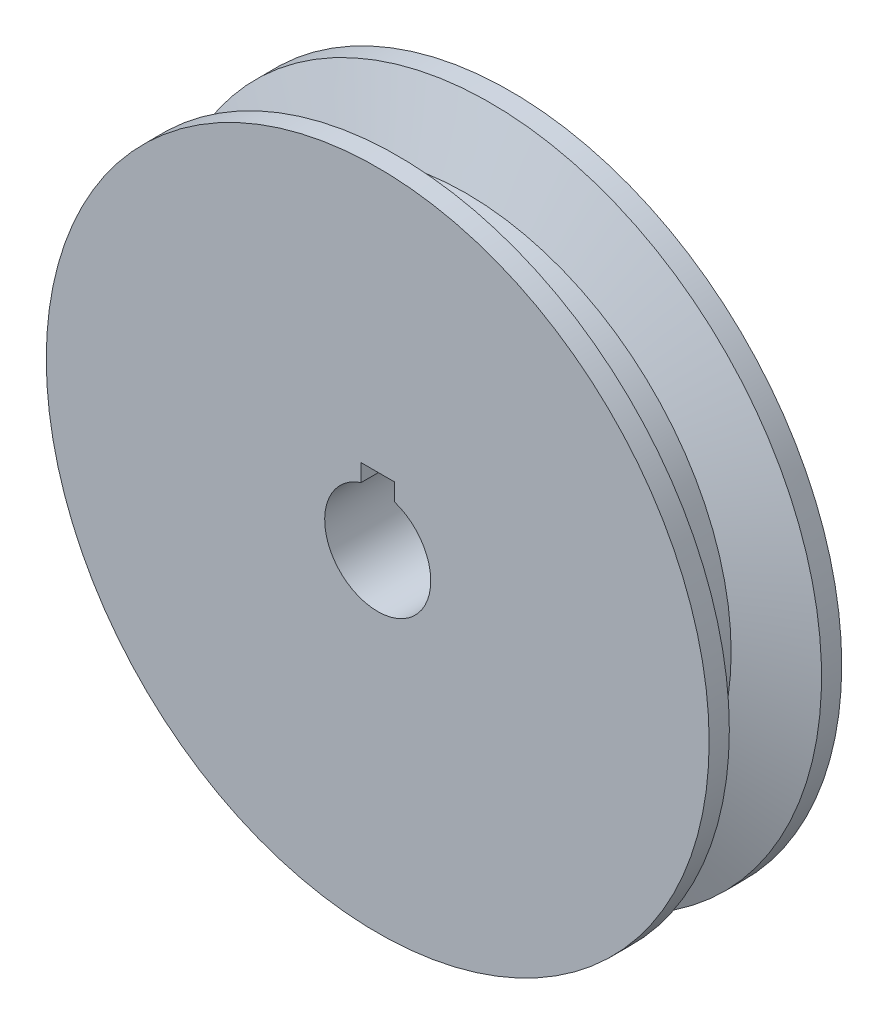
ISO-10303-21;
HEADER;
FILE_DESCRIPTION(('STEP AP214'),'2;1');
FILE_NAME('part.step','',(''),(''),'','','');
FILE_SCHEMA(('AUTOMOTIVE_DESIGN { 1 0 10303 214 1 1 1 1 }'));
ENDSEC;
DATA;
#1=APPLICATION_CONTEXT('core data for automotive mechanical design processes');
#2=APPLICATION_PROTOCOL_DEFINITION('international standard','automotive_design',2000,#1);
#3=PRODUCT_CONTEXT('',#1,'mechanical');
#4=PRODUCT('Part','Part','',(#3));
#5=PRODUCT_RELATED_PRODUCT_CATEGORY('part','',(#4));
#6=PRODUCT_DEFINITION_FORMATION('','',#4);
#7=PRODUCT_DEFINITION_CONTEXT('part definition',#1,'design');
#8=PRODUCT_DEFINITION('design','',#6,#7);
#9=PRODUCT_DEFINITION_SHAPE('','',#8);
#10=(LENGTH_UNIT() NAMED_UNIT(*) SI_UNIT(.MILLI.,.METRE.));
#11=(NAMED_UNIT(*) PLANE_ANGLE_UNIT() SI_UNIT($,.RADIAN.));
#12=(NAMED_UNIT(*) SI_UNIT($,.STERADIAN.) SOLID_ANGLE_UNIT());
#13=UNCERTAINTY_MEASURE_WITH_UNIT(LENGTH_MEASURE(1.E-05),#10,'distance_accuracy_value','');
#14=(GEOMETRIC_REPRESENTATION_CONTEXT(3) GLOBAL_UNCERTAINTY_ASSIGNED_CONTEXT((#13)) GLOBAL_UNIT_ASSIGNED_CONTEXT((#10,
#11,#12)) REPRESENTATION_CONTEXT('',''));
#15=CARTESIAN_POINT('',(0.,0.,0.));
#16=DIRECTION('',(0.,0.,1.));
#17=DIRECTION('',(1.,0.,0.));
#18=AXIS2_PLACEMENT_3D('',#15,#16,#17);
#19=CARTESIAN_POINT('',(0.,0.,10.));
#20=DIRECTION('',(0.,0.,-1.));
#21=DIRECTION('',(-1.,0.,0.));
#22=AXIS2_PLACEMENT_3D('',#19,#20,#21);
#23=CYLINDRICAL_SURFACE('',#22,50.);
#24=CARTESIAN_POINT('',(0.,0.,-10.));
#25=DIRECTION('',(0.,0.,1.));
#26=DIRECTION('',(1.,0.,0.));
#27=AXIS2_PLACEMENT_3D('',#24,#25,#26);
#28=CIRCLE('',#27,50.);
#29=CARTESIAN_POINT('',(50.,0.,-10.));
#30=VERTEX_POINT('',#29);
#31=EDGE_CURVE('E110',#30,#30,#28,.T.);
#32=ORIENTED_EDGE('',*,*,#31,.T.);
#33=EDGE_LOOP('',(#32));
#34=FACE_BOUND('',#33,.T.);
#35=CARTESIAN_POINT('',(0.,0.,-6.9558809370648));
#36=DIRECTION('',(0.,0.,-1.));
#37=DIRECTION('',(-1.,0.,0.));
#38=AXIS2_PLACEMENT_3D('',#35,#36,#37);
#39=CIRCLE('',#38,50.);
#40=CARTESIAN_POINT('',(-50.,0.,-6.9558809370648));
#41=VERTEX_POINT('',#40);
#42=EDGE_CURVE('E90',#41,#41,#39,.T.);
#43=ORIENTED_EDGE('',*,*,#42,.T.);
#44=EDGE_LOOP('',(#43));
#45=FACE_BOUND('',#44,.T.);
#46=ADVANCED_FACE('F32',(#34,#45),#23,.T.);
#47=CARTESIAN_POINT('',(0.,0.,10.));
#48=DIRECTION('',(0.,0.,1.));
#49=DIRECTION('',(1.,0.,0.));
#50=AXIS2_PLACEMENT_3D('',#47,#48,#49);
#51=PLANE('',#50);
#52=DIRECTION('',(0.,1.,0.));
#53=VECTOR('',#52,1.);
#54=CARTESIAN_POINT('',(2.5,10.2,10.));
#55=LINE('',#54,#53);
#56=CARTESIAN_POINT('',(2.5,7.59934207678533,10.));
#57=VERTEX_POINT('',#56);
#58=CARTESIAN_POINT('',(2.5,10.2,10.));
#59=VERTEX_POINT('',#58);
#60=EDGE_CURVE('E84',#57,#59,#55,.T.);
#61=ORIENTED_EDGE('',*,*,#60,.F.);
#62=CARTESIAN_POINT('',(0.,0.,10.));
#63=DIRECTION('',(0.,0.,1.));
#64=DIRECTION('',(1.,0.,0.));
#65=AXIS2_PLACEMENT_3D('',#62,#63,#64);
#66=CIRCLE('',#65,8.);
#67=CARTESIAN_POINT('',(-2.5,7.59934207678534,10.));
#68=VERTEX_POINT('',#67);
#69=EDGE_CURVE('E113',#68,#57,#66,.T.);
#70=ORIENTED_EDGE('',*,*,#69,.F.);
#71=DIRECTION('',(0.,-1.,0.));
#72=VECTOR('',#71,1.);
#73=CARTESIAN_POINT('',(-2.5,10.2,10.));
#74=LINE('',#73,#72);
#75=CARTESIAN_POINT('',(-2.5,10.2,10.));
#76=VERTEX_POINT('',#75);
#77=EDGE_CURVE('E94',#76,#68,#74,.T.);
#78=ORIENTED_EDGE('',*,*,#77,.F.);
#79=DIRECTION('',(-1.,0.,0.));
#80=VECTOR('',#79,1.);
#81=CARTESIAN_POINT('',(-2.5,10.2,10.));
#82=LINE('',#81,#80);
#83=EDGE_CURVE('E77',#59,#76,#82,.T.);
#84=ORIENTED_EDGE('',*,*,#83,.F.);
#85=EDGE_LOOP('',(#61,#70,#78,#84));
#86=FACE_BOUND('',#85,.T.);
#87=CARTESIAN_POINT('',(0.,0.,10.));
#88=DIRECTION('',(0.,0.,1.));
#89=DIRECTION('',(1.,0.,0.));
#90=AXIS2_PLACEMENT_3D('',#87,#88,#89);
#91=CIRCLE('',#90,50.);
#92=CARTESIAN_POINT('',(50.,0.,10.));
#93=VERTEX_POINT('',#92);
#94=EDGE_CURVE('E115',#93,#93,#91,.T.);
#95=ORIENTED_EDGE('',*,*,#94,.T.);
#96=EDGE_LOOP('',(#95));
#97=FACE_BOUND('',#96,.T.);
#98=ADVANCED_FACE('F92',(#86,#97),#51,.T.);
#99=ORIENTED_EDGE('',*,*,#94,.F.);
#100=EDGE_LOOP('',(#99));
#101=FACE_BOUND('',#100,.T.);
#102=CARTESIAN_POINT('',(0.,0.,6.9558809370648));
#103=DIRECTION('',(0.,0.,-1.));
#104=DIRECTION('',(-1.,0.,0.));
#105=AXIS2_PLACEMENT_3D('',#102,#103,#104);
#106=CIRCLE('',#105,50.);
#107=CARTESIAN_POINT('',(-50.,0.,6.9558809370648));
#108=VERTEX_POINT('',#107);
#109=EDGE_CURVE('E155',#108,#108,#106,.T.);
#110=ORIENTED_EDGE('',*,*,#109,.F.);
#111=EDGE_LOOP('',(#110));
#112=FACE_BOUND('',#111,.T.);
#113=ADVANCED_FACE('F34',(#101,#112),#23,.T.);
#114=CARTESIAN_POINT('',(0.,0.,10.));
#115=DIRECTION('',(0.,0.,-1.));
#116=DIRECTION('',(-1.,0.,0.));
#117=AXIS2_PLACEMENT_3D('',#114,#115,#116);
#118=CYLINDRICAL_SURFACE('',#117,8.);
#119=DIRECTION('',(0.,0.,1.));
#120=VECTOR('',#119,1.);
#121=CARTESIAN_POINT('',(2.5,7.59934207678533,-10.));
#122=LINE('',#121,#120);
#123=CARTESIAN_POINT('',(2.5,7.59934207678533,-10.));
#124=VERTEX_POINT('',#123);
#125=EDGE_CURVE('E86',#124,#57,#122,.T.);
#126=ORIENTED_EDGE('',*,*,#125,.F.);
#127=CARTESIAN_POINT('',(0.,0.,-10.));
#128=DIRECTION('',(0.,0.,1.));
#129=DIRECTION('',(1.,0.,0.));
#130=AXIS2_PLACEMENT_3D('',#127,#128,#129);
#131=CIRCLE('',#130,8.);
#132=CARTESIAN_POINT('',(-2.5,7.59934207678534,-10.));
#133=VERTEX_POINT('',#132);
#134=EDGE_CURVE('E103',#133,#124,#131,.T.);
#135=ORIENTED_EDGE('',*,*,#134,.F.);
#136=DIRECTION('',(0.,0.,1.));
#137=VECTOR('',#136,1.);
#138=CARTESIAN_POINT('',(-2.5,7.59934207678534,-10.));
#139=LINE('',#138,#137);
#140=EDGE_CURVE('E104',#133,#68,#139,.T.);
#141=ORIENTED_EDGE('',*,*,#140,.T.);
#142=ORIENTED_EDGE('',*,*,#69,.T.);
#143=EDGE_LOOP('',(#126,#135,#141,#142));
#144=FACE_BOUND('',#143,.T.);
#145=ADVANCED_FACE('F134',(#144),#118,.F.);
#146=CARTESIAN_POINT('',(0.,0.,-10.));
#147=DIRECTION('',(0.,0.,1.));
#148=DIRECTION('',(1.,0.,0.));
#149=AXIS2_PLACEMENT_3D('',#146,#147,#148);
#150=PLANE('',#149);
#151=ORIENTED_EDGE('',*,*,#134,.T.);
#152=DIRECTION('',(0.,1.,0.));
#153=VECTOR('',#152,1.);
#154=CARTESIAN_POINT('',(2.5,10.2,-10.));
#155=LINE('',#154,#153);
#156=CARTESIAN_POINT('',(2.5,10.2,-10.));
#157=VERTEX_POINT('',#156);
#158=EDGE_CURVE('E55',#124,#157,#155,.T.);
#159=ORIENTED_EDGE('',*,*,#158,.T.);
#160=DIRECTION('',(-1.,0.,0.));
#161=VECTOR('',#160,1.);
#162=CARTESIAN_POINT('',(-2.5,10.2,-10.));
#163=LINE('',#162,#161);
#164=CARTESIAN_POINT('',(-2.5,10.2,-10.));
#165=VERTEX_POINT('',#164);
#166=EDGE_CURVE('E80',#157,#165,#163,.T.);
#167=ORIENTED_EDGE('',*,*,#166,.T.);
#168=DIRECTION('',(0.,-1.,0.));
#169=VECTOR('',#168,1.);
#170=CARTESIAN_POINT('',(-2.5,10.2,-10.));
#171=LINE('',#170,#169);
#172=EDGE_CURVE('E47',#165,#133,#171,.T.);
#173=ORIENTED_EDGE('',*,*,#172,.T.);
#174=EDGE_LOOP('',(#151,#159,#167,#173));
#175=FACE_BOUND('',#174,.T.);
#176=ORIENTED_EDGE('',*,*,#31,.F.);
#177=EDGE_LOOP('',(#176));
#178=FACE_BOUND('',#177,.T.);
#179=ADVANCED_FACE('F125',(#175,#178),#150,.F.);
#180=CARTESIAN_POINT('',(0.,0.,-8.));
#181=DIRECTION('',(0.,0.,1.));
#182=DIRECTION('',(1.,0.,0.));
#183=AXIS2_PLACEMENT_3D('',#180,#181,#182);
#184=CYLINDRICAL_SURFACE('',#183,40.);
#185=CARTESIAN_POINT('',(0.,0.,3.31617859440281));
#186=DIRECTION('',(0.,0.,1.));
#187=DIRECTION('',(1.,0.,0.));
#188=AXIS2_PLACEMENT_3D('',#185,#186,#187);
#189=CIRCLE('',#188,40.);
#190=CARTESIAN_POINT('',(40.,0.,3.31617859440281));
#191=VERTEX_POINT('',#190);
#192=EDGE_CURVE('E12',#191,#191,#189,.T.);
#193=ORIENTED_EDGE('',*,*,#192,.F.);
#194=EDGE_LOOP('',(#193));
#195=FACE_BOUND('',#194,.T.);
#196=CARTESIAN_POINT('',(0.,0.,-3.31617859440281));
#197=DIRECTION('',(0.,0.,-1.));
#198=DIRECTION('',(-1.,0.,0.));
#199=AXIS2_PLACEMENT_3D('',#196,#197,#198);
#200=CIRCLE('',#199,40.);
#201=CARTESIAN_POINT('',(-40.,0.,-3.31617859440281));
#202=VERTEX_POINT('',#201);
#203=EDGE_CURVE('E40',#202,#202,#200,.T.);
#204=ORIENTED_EDGE('',*,*,#203,.F.);
#205=EDGE_LOOP('',(#204));
#206=FACE_BOUND('',#205,.T.);
#207=ADVANCED_FACE('F123',(#195,#206),#184,.T.);
#208=CARTESIAN_POINT('',(2.5,10.2,-10.));
#209=DIRECTION('',(1.,0.,0.));
#210=DIRECTION('',(0.,1.,0.));
#211=AXIS2_PLACEMENT_3D('',#208,#209,#210);
#212=PLANE('',#211);
#213=ORIENTED_EDGE('',*,*,#60,.T.);
#214=DIRECTION('',(0.,0.,1.));
#215=VECTOR('',#214,1.);
#216=CARTESIAN_POINT('',(2.5,10.2,-10.));
#217=LINE('',#216,#215);
#218=EDGE_CURVE('E73',#157,#59,#217,.T.);
#219=ORIENTED_EDGE('',*,*,#218,.F.);
#220=ORIENTED_EDGE('',*,*,#158,.F.);
#221=ORIENTED_EDGE('',*,*,#125,.T.);
#222=EDGE_LOOP('',(#213,#219,#220,#221));
#223=FACE_BOUND('',#222,.T.);
#224=ADVANCED_FACE('F85',(#223),#212,.F.);
#225=CARTESIAN_POINT('',(-2.5,10.2,-10.));
#226=DIRECTION('',(-1.,0.,0.));
#227=DIRECTION('',(0.,-1.,0.));
#228=AXIS2_PLACEMENT_3D('',#225,#226,#227);
#229=PLANE('',#228);
#230=ORIENTED_EDGE('',*,*,#77,.T.);
#231=ORIENTED_EDGE('',*,*,#140,.F.);
#232=ORIENTED_EDGE('',*,*,#172,.F.);
#233=DIRECTION('',(0.,0.,1.));
#234=VECTOR('',#233,1.);
#235=CARTESIAN_POINT('',(-2.5,10.2,-10.));
#236=LINE('',#235,#234);
#237=EDGE_CURVE('E81',#165,#76,#236,.T.);
#238=ORIENTED_EDGE('',*,*,#237,.T.);
#239=EDGE_LOOP('',(#230,#231,#232,#238));
#240=FACE_BOUND('',#239,.T.);
#241=ADVANCED_FACE('F132',(#240),#229,.F.);
#242=CARTESIAN_POINT('',(-2.5,10.2,-10.));
#243=DIRECTION('',(0.,1.,0.));
#244=DIRECTION('',(-1.,0.,0.));
#245=AXIS2_PLACEMENT_3D('',#242,#243,#244);
#246=PLANE('',#245);
#247=ORIENTED_EDGE('',*,*,#83,.T.);
#248=ORIENTED_EDGE('',*,*,#237,.F.);
#249=ORIENTED_EDGE('',*,*,#166,.F.);
#250=ORIENTED_EDGE('',*,*,#218,.T.);
#251=EDGE_LOOP('',(#247,#248,#249,#250));
#252=FACE_BOUND('',#251,.T.);
#253=ADVANCED_FACE('F75',(#252),#246,.F.);
#254=CARTESIAN_POINT('',(0.,0.,-6.9558809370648));
#255=DIRECTION('',(0.,0.,-1.));
#256=DIRECTION('',(-1.,0.,0.));
#257=AXIS2_PLACEMENT_3D('',#254,#255,#256);
#258=CONICAL_SURFACE('',#257,50.,1.22173047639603);
#259=ORIENTED_EDGE('',*,*,#203,.T.);
#260=EDGE_LOOP('',(#259));
#261=FACE_BOUND('',#260,.T.);
#262=ORIENTED_EDGE('',*,*,#42,.F.);
#263=EDGE_LOOP('',(#262));
#264=FACE_BOUND('',#263,.T.);
#265=ADVANCED_FACE('F120',(#261,#264),#258,.T.);
#266=CARTESIAN_POINT('',(0.,0.,3.31617859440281));
#267=DIRECTION('',(0.,0.,1.));
#268=DIRECTION('',(1.,0.,0.));
#269=AXIS2_PLACEMENT_3D('',#266,#267,#268);
#270=CONICAL_SURFACE('',#269,40.,1.22173047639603);
#271=ORIENTED_EDGE('',*,*,#109,.T.);
#272=EDGE_LOOP('',(#271));
#273=FACE_BOUND('',#272,.T.);
#274=ORIENTED_EDGE('',*,*,#192,.T.);
#275=EDGE_LOOP('',(#274));
#276=FACE_BOUND('',#275,.T.);
#277=ADVANCED_FACE('F161',(#273,#276),#270,.T.);
#278=CLOSED_SHELL('',(#46,#98,#113,#145,#179,#207,#224,#241,#253,#265,#277));
#279=MANIFOLD_SOLID_BREP('B2',#278);
#280=ADVANCED_BREP_SHAPE_REPRESENTATION('',(#18,#279),#14);
#281=SHAPE_DEFINITION_REPRESENTATION(#9,#280);
ENDSEC;
END-ISO-10303-21;
